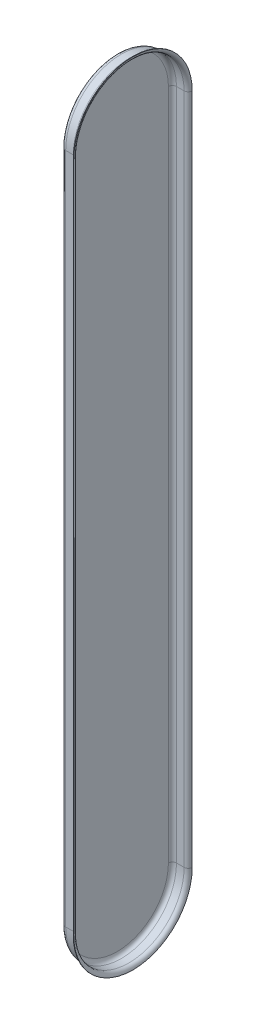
ISO-10303-21;
HEADER;
FILE_DESCRIPTION(('STEP AP214'),'2;1');
FILE_NAME('part.step','',(''),(''),'','','');
FILE_SCHEMA(('AUTOMOTIVE_DESIGN { 1 0 10303 214 1 1 1 1 }'));
ENDSEC;
DATA;
#1=APPLICATION_CONTEXT('core data for automotive mechanical design processes');
#2=APPLICATION_PROTOCOL_DEFINITION('international standard','automotive_design',2000,#1);
#3=PRODUCT_CONTEXT('',#1,'mechanical');
#4=PRODUCT('Part','Part','',(#3));
#5=PRODUCT_RELATED_PRODUCT_CATEGORY('part','',(#4));
#6=PRODUCT_DEFINITION_FORMATION('','',#4);
#7=PRODUCT_DEFINITION_CONTEXT('part definition',#1,'design');
#8=PRODUCT_DEFINITION('design','',#6,#7);
#9=PRODUCT_DEFINITION_SHAPE('','',#8);
#10=(LENGTH_UNIT() NAMED_UNIT(*) SI_UNIT(.MILLI.,.METRE.));
#11=(NAMED_UNIT(*) PLANE_ANGLE_UNIT() SI_UNIT($,.RADIAN.));
#12=(NAMED_UNIT(*) SI_UNIT($,.STERADIAN.) SOLID_ANGLE_UNIT());
#13=UNCERTAINTY_MEASURE_WITH_UNIT(LENGTH_MEASURE(1.E-05),#10,'distance_accuracy_value','');
#14=(GEOMETRIC_REPRESENTATION_CONTEXT(3) GLOBAL_UNCERTAINTY_ASSIGNED_CONTEXT((#13)) GLOBAL_UNIT_ASSIGNED_CONTEXT((#10,
#11,#12)) REPRESENTATION_CONTEXT('',''));
#15=CARTESIAN_POINT('',(0.,0.,0.));
#16=DIRECTION('',(0.,0.,1.));
#17=DIRECTION('',(1.,0.,0.));
#18=AXIS2_PLACEMENT_3D('',#15,#16,#17);
#19=CARTESIAN_POINT('',(-39.35,19.28,3.99999999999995));
#20=DIRECTION('',(-1.,0.,0.));
#21=DIRECTION('',(0.,-1.,0.));
#22=AXIS2_PLACEMENT_3D('',#19,#20,#21);
#23=PLANE('',#22);
#24=DIRECTION('',(0.,-1.,0.));
#25=VECTOR('',#24,1.);
#26=CARTESIAN_POINT('',(-39.35,19.28,5.13999999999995));
#27=LINE('',#26,#25);
#28=CARTESIAN_POINT('',(-39.35,34.27,5.13999999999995));
#29=VERTEX_POINT('',#28);
#30=CARTESIAN_POINT('',(-39.35,19.28,5.13999999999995));
#31=VERTEX_POINT('',#30);
#32=EDGE_CURVE('E133',#29,#31,#27,.T.);
#33=ORIENTED_EDGE('',*,*,#32,.T.);
#34=CARTESIAN_POINT('',(-39.35,19.28,3.99999999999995));
#35=DIRECTION('',(-1.,0.,0.));
#36=DIRECTION('',(0.,0.,-1.));
#37=AXIS2_PLACEMENT_3D('',#34,#35,#36);
#38=CIRCLE('',#37,1.14);
#39=CARTESIAN_POINT('',(-39.35,19.28,2.85999999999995));
#40=VERTEX_POINT('',#39);
#41=EDGE_CURVE('E162',#31,#40,#38,.F.);
#42=ORIENTED_EDGE('',*,*,#41,.T.);
#43=DIRECTION('',(0.,1.,0.));
#44=VECTOR('',#43,1.);
#45=CARTESIAN_POINT('',(-39.35,19.28,2.85999999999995));
#46=LINE('',#45,#44);
#47=CARTESIAN_POINT('',(-39.35,34.27,2.85999999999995));
#48=VERTEX_POINT('',#47);
#49=EDGE_CURVE('E136',#40,#48,#46,.T.);
#50=ORIENTED_EDGE('',*,*,#49,.T.);
#51=CARTESIAN_POINT('',(-39.35,34.27,3.99999999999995));
#52=DIRECTION('',(-1.,0.,0.));
#53=DIRECTION('',(0.,0.,1.));
#54=AXIS2_PLACEMENT_3D('',#51,#52,#53);
#55=CIRCLE('',#54,1.14);
#56=EDGE_CURVE('E129',#48,#29,#55,.F.);
#57=ORIENTED_EDGE('',*,*,#56,.T.);
#58=EDGE_LOOP('',(#33,#42,#50,#57));
#59=FACE_BOUND('',#58,.T.);
#60=ADVANCED_FACE('F17',(#59),#23,.F.);
#61=CARTESIAN_POINT('',(-39.26,34.27,3.99999999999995));
#62=DIRECTION('',(-1.,0.,0.));
#63=DIRECTION('',(0.,1.,0.));
#64=AXIS2_PLACEMENT_3D('',#61,#62,#63);
#65=TOROIDAL_SURFACE('',#64,1.14,0.09);
#66=ORIENTED_EDGE('',*,*,#56,.F.);
#67=CARTESIAN_POINT('',(-39.26,34.27,2.85999999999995));
#68=DIRECTION('',(0.,1.,0.));
#69=DIRECTION('',(-1.,0.,0.));
#70=AXIS2_PLACEMENT_3D('',#67,#68,#69);
#71=CIRCLE('',#70,0.0899999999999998);
#72=CARTESIAN_POINT('',(-39.26,34.27,2.76999999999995));
#73=VERTEX_POINT('',#72);
#74=EDGE_CURVE('E173',#48,#73,#71,.F.);
#75=ORIENTED_EDGE('',*,*,#74,.T.);
#76=CARTESIAN_POINT('',(-39.26,34.27,3.99999999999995));
#77=DIRECTION('',(1.,0.,0.));
#78=DIRECTION('',(0.,1.,0.));
#79=AXIS2_PLACEMENT_3D('',#76,#77,#78);
#80=CIRCLE('',#79,1.23);
#81=CARTESIAN_POINT('',(-39.26,34.27,5.22999999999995));
#82=VERTEX_POINT('',#81);
#83=EDGE_CURVE('E145',#73,#82,#80,.T.);
#84=ORIENTED_EDGE('',*,*,#83,.T.);
#85=CARTESIAN_POINT('',(-39.26,34.27,5.13999999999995));
#86=DIRECTION('',(0.,-1.,0.));
#87=DIRECTION('',(1.,0.,0.));
#88=AXIS2_PLACEMENT_3D('',#85,#86,#87);
#89=CIRCLE('',#88,0.0899999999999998);
#90=EDGE_CURVE('E142',#82,#29,#89,.T.);
#91=ORIENTED_EDGE('',*,*,#90,.T.);
#92=EDGE_LOOP('',(#66,#75,#84,#91));
#93=FACE_BOUND('',#92,.T.);
#94=ADVANCED_FACE('F143',(#93),#65,.F.);
#95=CARTESIAN_POINT('',(-39.26,19.28,2.85999999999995));
#96=DIRECTION('',(0.,1.,0.));
#97=DIRECTION('',(-1.,0.,0.));
#98=AXIS2_PLACEMENT_3D('',#95,#96,#97);
#99=CYLINDRICAL_SURFACE('',#98,0.0899999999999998);
#100=ORIENTED_EDGE('',*,*,#49,.F.);
#101=CARTESIAN_POINT('',(-39.26,19.28,2.85999999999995));
#102=DIRECTION('',(0.,-1.,0.));
#103=DIRECTION('',(0.,0.,-1.));
#104=AXIS2_PLACEMENT_3D('',#101,#102,#103);
#105=CIRCLE('',#104,0.09);
#106=CARTESIAN_POINT('',(-39.26,19.28,2.76999999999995));
#107=VERTEX_POINT('',#106);
#108=EDGE_CURVE('E149',#40,#107,#105,.T.);
#109=ORIENTED_EDGE('',*,*,#108,.T.);
#110=DIRECTION('',(0.,1.,0.));
#111=VECTOR('',#110,1.);
#112=CARTESIAN_POINT('',(-39.26,19.28,2.76999999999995));
#113=LINE('',#112,#111);
#114=EDGE_CURVE('E200',#73,#107,#113,.F.);
#115=ORIENTED_EDGE('',*,*,#114,.F.);
#116=ORIENTED_EDGE('',*,*,#74,.F.);
#117=EDGE_LOOP('',(#100,#109,#115,#116));
#118=FACE_BOUND('',#117,.T.);
#119=ADVANCED_FACE('F175',(#118),#99,.F.);
#120=CARTESIAN_POINT('',(-39.26,19.28,3.99999999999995));
#121=DIRECTION('',(-1.,0.,0.));
#122=DIRECTION('',(0.,-1.,0.));
#123=AXIS2_PLACEMENT_3D('',#120,#121,#122);
#124=TOROIDAL_SURFACE('',#123,1.14,0.09);
#125=ORIENTED_EDGE('',*,*,#108,.F.);
#126=ORIENTED_EDGE('',*,*,#41,.F.);
#127=CARTESIAN_POINT('',(-39.26,19.28,5.13999999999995));
#128=DIRECTION('',(0.,-1.,0.));
#129=DIRECTION('',(1.,0.,0.));
#130=AXIS2_PLACEMENT_3D('',#127,#128,#129);
#131=CIRCLE('',#130,0.0899999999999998);
#132=CARTESIAN_POINT('',(-39.26,19.28,5.22999999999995));
#133=VERTEX_POINT('',#132);
#134=EDGE_CURVE('E153',#31,#133,#131,.F.);
#135=ORIENTED_EDGE('',*,*,#134,.T.);
#136=CARTESIAN_POINT('',(-39.26,19.28,3.99999999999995));
#137=DIRECTION('',(1.,0.,0.));
#138=DIRECTION('',(0.,1.,0.));
#139=AXIS2_PLACEMENT_3D('',#136,#137,#138);
#140=CIRCLE('',#139,1.23);
#141=EDGE_CURVE('E181',#133,#107,#140,.T.);
#142=ORIENTED_EDGE('',*,*,#141,.T.);
#143=EDGE_LOOP('',(#125,#126,#135,#142));
#144=FACE_BOUND('',#143,.T.);
#145=ADVANCED_FACE('F179',(#144),#124,.F.);
#146=CARTESIAN_POINT('',(-39.26,19.28,5.13999999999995));
#147=DIRECTION('',(0.,-1.,0.));
#148=DIRECTION('',(1.,0.,0.));
#149=AXIS2_PLACEMENT_3D('',#146,#147,#148);
#150=CYLINDRICAL_SURFACE('',#149,0.0899999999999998);
#151=ORIENTED_EDGE('',*,*,#32,.F.);
#152=ORIENTED_EDGE('',*,*,#90,.F.);
#153=DIRECTION('',(0.,1.,0.));
#154=VECTOR('',#153,1.);
#155=CARTESIAN_POINT('',(-39.26,19.28,5.22999999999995));
#156=LINE('',#155,#154);
#157=EDGE_CURVE('E218',#133,#82,#156,.T.);
#158=ORIENTED_EDGE('',*,*,#157,.F.);
#159=ORIENTED_EDGE('',*,*,#134,.F.);
#160=EDGE_LOOP('',(#151,#152,#158,#159));
#161=FACE_BOUND('',#160,.T.);
#162=ADVANCED_FACE('F152',(#161),#150,.F.);
#163=CARTESIAN_POINT('',(-39.35,34.27,3.99999999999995));
#164=DIRECTION('',(1.,0.,0.));
#165=DIRECTION('',(0.,1.,0.));
#166=AXIS2_PLACEMENT_3D('',#163,#164,#165);
#167=CYLINDRICAL_SURFACE('',#166,1.23);
#168=DIRECTION('',(1.,0.,0.));
#169=VECTOR('',#168,1.);
#170=CARTESIAN_POINT('',(-39.35,34.27,2.76999999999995));
#171=LINE('',#170,#169);
#172=CARTESIAN_POINT('',(-39.09,34.27,2.76999999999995));
#173=VERTEX_POINT('',#172);
#174=EDGE_CURVE('E194',#173,#73,#171,.F.);
#175=ORIENTED_EDGE('',*,*,#174,.F.);
#176=CARTESIAN_POINT('',(-39.09,34.27,3.99999999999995));
#177=DIRECTION('',(-1.,0.,0.));
#178=DIRECTION('',(0.,1.,0.));
#179=AXIS2_PLACEMENT_3D('',#176,#177,#178);
#180=CIRCLE('',#179,1.23);
#181=CARTESIAN_POINT('',(-39.09,34.27,5.22999999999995));
#182=VERTEX_POINT('',#181);
#183=EDGE_CURVE('E250',#182,#173,#180,.T.);
#184=ORIENTED_EDGE('',*,*,#183,.F.);
#185=DIRECTION('',(-1.,0.,0.));
#186=VECTOR('',#185,1.);
#187=CARTESIAN_POINT('',(-39.35,34.27,5.22999999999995));
#188=LINE('',#187,#186);
#189=EDGE_CURVE('E197',#82,#182,#188,.F.);
#190=ORIENTED_EDGE('',*,*,#189,.F.);
#191=ORIENTED_EDGE('',*,*,#83,.F.);
#192=EDGE_LOOP('',(#175,#184,#190,#191));
#193=FACE_BOUND('',#192,.T.);
#194=ADVANCED_FACE('F192',(#193),#167,.F.);
#195=CARTESIAN_POINT('',(-39.35,19.28,2.76999999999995));
#196=DIRECTION('',(0.,0.,1.));
#197=DIRECTION('',(1.,0.,0.));
#198=AXIS2_PLACEMENT_3D('',#195,#196,#197);
#199=PLANE('',#198);
#200=DIRECTION('',(1.,0.,0.));
#201=VECTOR('',#200,1.);
#202=CARTESIAN_POINT('',(-39.35,19.28,2.76999999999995));
#203=LINE('',#202,#201);
#204=CARTESIAN_POINT('',(-39.09,19.28,2.76999999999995));
#205=VERTEX_POINT('',#204);
#206=EDGE_CURVE('E228',#107,#205,#203,.T.);
#207=ORIENTED_EDGE('',*,*,#206,.T.);
#208=DIRECTION('',(0.,-1.,0.));
#209=VECTOR('',#208,1.);
#210=CARTESIAN_POINT('',(-39.09,19.28,2.76999999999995));
#211=LINE('',#210,#209);
#212=EDGE_CURVE('E207',#173,#205,#211,.T.);
#213=ORIENTED_EDGE('',*,*,#212,.F.);
#214=ORIENTED_EDGE('',*,*,#174,.T.);
#215=ORIENTED_EDGE('',*,*,#114,.T.);
#216=EDGE_LOOP('',(#207,#213,#214,#215));
#217=FACE_BOUND('',#216,.T.);
#218=ADVANCED_FACE('F205',(#217),#199,.T.);
#219=CARTESIAN_POINT('',(-39.35,19.28,3.99999999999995));
#220=DIRECTION('',(1.,0.,0.));
#221=DIRECTION('',(0.,1.,0.));
#222=AXIS2_PLACEMENT_3D('',#219,#220,#221);
#223=CYLINDRICAL_SURFACE('',#222,1.23);
#224=CARTESIAN_POINT('',(-39.09,19.28,3.99999999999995));
#225=DIRECTION('',(-1.,0.,0.));
#226=DIRECTION('',(0.,-1.,0.));
#227=AXIS2_PLACEMENT_3D('',#224,#225,#226);
#228=CIRCLE('',#227,1.23);
#229=CARTESIAN_POINT('',(-39.09,19.28,5.22999999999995));
#230=VERTEX_POINT('',#229);
#231=EDGE_CURVE('E238',#205,#230,#228,.T.);
#232=ORIENTED_EDGE('',*,*,#231,.F.);
#233=ORIENTED_EDGE('',*,*,#206,.F.);
#234=ORIENTED_EDGE('',*,*,#141,.F.);
#235=DIRECTION('',(-1.,0.,0.));
#236=VECTOR('',#235,1.);
#237=CARTESIAN_POINT('',(-39.35,19.28,5.22999999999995));
#238=LINE('',#237,#236);
#239=EDGE_CURVE('E220',#230,#133,#238,.T.);
#240=ORIENTED_EDGE('',*,*,#239,.F.);
#241=EDGE_LOOP('',(#232,#233,#234,#240));
#242=FACE_BOUND('',#241,.T.);
#243=ADVANCED_FACE('F276',(#242),#223,.F.);
#244=CARTESIAN_POINT('',(-39.35,19.28,5.22999999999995));
#245=DIRECTION('',(0.,0.,-1.));
#246=DIRECTION('',(-1.,0.,0.));
#247=AXIS2_PLACEMENT_3D('',#244,#245,#246);
#248=PLANE('',#247);
#249=ORIENTED_EDGE('',*,*,#189,.T.);
#250=DIRECTION('',(0.,1.,0.));
#251=VECTOR('',#250,1.);
#252=CARTESIAN_POINT('',(-39.09,19.28,5.22999999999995));
#253=LINE('',#252,#251);
#254=EDGE_CURVE('E253',#230,#182,#253,.T.);
#255=ORIENTED_EDGE('',*,*,#254,.F.);
#256=ORIENTED_EDGE('',*,*,#239,.T.);
#257=ORIENTED_EDGE('',*,*,#157,.T.);
#258=EDGE_LOOP('',(#249,#255,#256,#257));
#259=FACE_BOUND('',#258,.T.);
#260=ADVANCED_FACE('F271',(#259),#248,.T.);
#261=CARTESIAN_POINT('',(-39.09,34.27,3.99999999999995));
#262=DIRECTION('',(-1.,0.,0.));
#263=DIRECTION('',(0.,1.,0.));
#264=AXIS2_PLACEMENT_3D('',#261,#262,#263);
#265=TOROIDAL_SURFACE('',#264,1.32,0.09);
#266=CARTESIAN_POINT('',(-39.09,34.27,2.67999999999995));
#267=DIRECTION('',(0.,-1.,0.));
#268=DIRECTION('',(1.,0.,0.));
#269=AXIS2_PLACEMENT_3D('',#266,#267,#268);
#270=CIRCLE('',#269,0.0899999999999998);
#271=CARTESIAN_POINT('',(-39.,34.27,2.67999999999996));
#272=VERTEX_POINT('',#271);
#273=EDGE_CURVE('E239',#272,#173,#270,.T.);
#274=ORIENTED_EDGE('',*,*,#273,.F.);
#275=CARTESIAN_POINT('',(-39.,34.27,3.99999999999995));
#276=DIRECTION('',(-1.,0.,0.));
#277=DIRECTION('',(0.,-1.,0.));
#278=AXIS2_PLACEMENT_3D('',#275,#276,#277);
#279=CIRCLE('',#278,1.32);
#280=CARTESIAN_POINT('',(-39.,34.27,5.31999999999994));
#281=VERTEX_POINT('',#280);
#282=EDGE_CURVE('E533',#281,#272,#279,.T.);
#283=ORIENTED_EDGE('',*,*,#282,.F.);
#284=CARTESIAN_POINT('',(-39.09,34.27,5.31999999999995));
#285=DIRECTION('',(0.,1.,0.));
#286=DIRECTION('',(-1.,0.,0.));
#287=AXIS2_PLACEMENT_3D('',#284,#285,#286);
#288=CIRCLE('',#287,0.0899999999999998);
#289=EDGE_CURVE('E256',#182,#281,#288,.F.);
#290=ORIENTED_EDGE('',*,*,#289,.F.);
#291=ORIENTED_EDGE('',*,*,#183,.T.);
#292=EDGE_LOOP('',(#274,#283,#290,#291));
#293=FACE_BOUND('',#292,.T.);
#294=ADVANCED_FACE('F266',(#293),#265,.T.);
#295=CARTESIAN_POINT('',(-39.09,19.28,2.67999999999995));
#296=DIRECTION('',(0.,-1.,0.));
#297=DIRECTION('',(1.,0.,0.));
#298=AXIS2_PLACEMENT_3D('',#295,#296,#297);
#299=CYLINDRICAL_SURFACE('',#298,0.0899999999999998);
#300=CARTESIAN_POINT('',(-39.09,19.28,2.67999999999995));
#301=DIRECTION('',(0.,-1.,0.));
#302=DIRECTION('',(0.,0.,-1.));
#303=AXIS2_PLACEMENT_3D('',#300,#301,#302);
#304=CIRCLE('',#303,0.09);
#305=CARTESIAN_POINT('',(-39.,19.28,2.67999999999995));
#306=VERTEX_POINT('',#305);
#307=EDGE_CURVE('E244',#306,#205,#304,.T.);
#308=ORIENTED_EDGE('',*,*,#307,.F.);
#309=DIRECTION('',(0.,1.,0.));
#310=VECTOR('',#309,1.);
#311=CARTESIAN_POINT('',(-39.,26.775,2.67999999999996));
#312=LINE('',#311,#310);
#313=EDGE_CURVE('E532',#306,#272,#312,.T.);
#314=ORIENTED_EDGE('',*,*,#313,.T.);
#315=ORIENTED_EDGE('',*,*,#273,.T.);
#316=ORIENTED_EDGE('',*,*,#212,.T.);
#317=EDGE_LOOP('',(#308,#314,#315,#316));
#318=FACE_BOUND('',#317,.T.);
#319=ADVANCED_FACE('F270',(#318),#299,.T.);
#320=CARTESIAN_POINT('',(-39.09,19.28,3.99999999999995));
#321=DIRECTION('',(-1.,0.,0.));
#322=DIRECTION('',(0.,-1.,0.));
#323=AXIS2_PLACEMENT_3D('',#320,#321,#322);
#324=TOROIDAL_SURFACE('',#323,1.32,0.09);
#325=CARTESIAN_POINT('',(-39.,19.28,3.99999999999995));
#326=DIRECTION('',(-1.,0.,0.));
#327=DIRECTION('',(0.,-1.,0.));
#328=AXIS2_PLACEMENT_3D('',#325,#326,#327);
#329=CIRCLE('',#328,1.32);
#330=CARTESIAN_POINT('',(-39.,19.28,5.31999999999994));
#331=VERTEX_POINT('',#330);
#332=EDGE_CURVE('E527',#306,#331,#329,.T.);
#333=ORIENTED_EDGE('',*,*,#332,.F.);
#334=ORIENTED_EDGE('',*,*,#307,.T.);
#335=ORIENTED_EDGE('',*,*,#231,.T.);
#336=CARTESIAN_POINT('',(-39.09,19.28,5.31999999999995));
#337=DIRECTION('',(0.,1.,0.));
#338=DIRECTION('',(-1.,0.,0.));
#339=AXIS2_PLACEMENT_3D('',#336,#337,#338);
#340=CIRCLE('',#339,0.0899999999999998);
#341=EDGE_CURVE('E257',#331,#230,#340,.T.);
#342=ORIENTED_EDGE('',*,*,#341,.F.);
#343=EDGE_LOOP('',(#333,#334,#335,#342));
#344=FACE_BOUND('',#343,.T.);
#345=ADVANCED_FACE('F563',(#344),#324,.T.);
#346=CARTESIAN_POINT('',(-39.09,19.28,5.31999999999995));
#347=DIRECTION('',(0.,1.,0.));
#348=DIRECTION('',(-1.,0.,0.));
#349=AXIS2_PLACEMENT_3D('',#346,#347,#348);
#350=CYLINDRICAL_SURFACE('',#349,0.0899999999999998);
#351=ORIENTED_EDGE('',*,*,#289,.T.);
#352=DIRECTION('',(0.,1.,0.));
#353=VECTOR('',#352,1.);
#354=CARTESIAN_POINT('',(-39.,26.775,5.31999999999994));
#355=LINE('',#354,#353);
#356=EDGE_CURVE('E508',#281,#331,#355,.F.);
#357=ORIENTED_EDGE('',*,*,#356,.T.);
#358=ORIENTED_EDGE('',*,*,#341,.T.);
#359=ORIENTED_EDGE('',*,*,#254,.T.);
#360=EDGE_LOOP('',(#351,#357,#358,#359));
#361=FACE_BOUND('',#360,.T.);
#362=ADVANCED_FACE('F566',(#361),#350,.T.);
#363=CARTESIAN_POINT('',(-39.09,34.27,3.99999999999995));
#364=DIRECTION('',(-1.,0.,0.));
#365=DIRECTION('',(0.,-1.,0.));
#366=AXIS2_PLACEMENT_3D('',#363,#364,#365);
#367=CYLINDRICAL_SURFACE('',#366,1.32);
#368=DIRECTION('',(1.,0.,1.35525271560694E-13));
#369=VECTOR('',#368,1.);
#370=CARTESIAN_POINT('',(-39.01,34.27,2.67999999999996));
#371=LINE('',#370,#369);
#372=CARTESIAN_POINT('',(-39.01,34.27,2.67999999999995));
#373=VERTEX_POINT('',#372);
#374=EDGE_CURVE('E530',#272,#373,#371,.F.);
#375=ORIENTED_EDGE('',*,*,#374,.T.);
#376=CARTESIAN_POINT('',(-39.01,34.27,3.99999999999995));
#377=DIRECTION('',(-1.,0.,0.));
#378=DIRECTION('',(0.,1.,0.));
#379=AXIS2_PLACEMENT_3D('',#376,#377,#378);
#380=CIRCLE('',#379,1.32);
#381=CARTESIAN_POINT('',(-39.01,34.27,5.31999999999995));
#382=VERTEX_POINT('',#381);
#383=EDGE_CURVE('E507',#373,#382,#380,.F.);
#384=ORIENTED_EDGE('',*,*,#383,.T.);
#385=DIRECTION('',(-1.,0.,1.30104260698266E-13));
#386=VECTOR('',#385,1.);
#387=CARTESIAN_POINT('',(-39.01,34.27,5.31999999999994));
#388=LINE('',#387,#386);
#389=EDGE_CURVE('E511',#382,#281,#388,.F.);
#390=ORIENTED_EDGE('',*,*,#389,.T.);
#391=ORIENTED_EDGE('',*,*,#282,.T.);
#392=EDGE_LOOP('',(#375,#384,#390,#391));
#393=FACE_BOUND('',#392,.T.);
#394=ADVANCED_FACE('F570',(#393),#367,.T.);
#395=CARTESIAN_POINT('',(-39.01,26.775,2.67999999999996));
#396=DIRECTION('',(-1.35525271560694E-13,0.,1.));
#397=DIRECTION('',(1.,0.,1.35525271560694E-13));
#398=AXIS2_PLACEMENT_3D('',#395,#396,#397);
#399=PLANE('',#398);
#400=DIRECTION('',(-1.,0.,0.));
#401=VECTOR('',#400,1.);
#402=CARTESIAN_POINT('',(-39.09,19.28,2.67999999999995));
#403=LINE('',#402,#401);
#404=CARTESIAN_POINT('',(-39.01,19.28,2.67999999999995));
#405=VERTEX_POINT('',#404);
#406=EDGE_CURVE('E514',#405,#306,#403,.F.);
#407=ORIENTED_EDGE('',*,*,#406,.F.);
#408=DIRECTION('',(0.,-1.,0.));
#409=VECTOR('',#408,1.);
#410=CARTESIAN_POINT('',(-39.01,19.28,2.67999999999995));
#411=LINE('',#410,#409);
#412=EDGE_CURVE('E518',#405,#373,#411,.F.);
#413=ORIENTED_EDGE('',*,*,#412,.T.);
#414=ORIENTED_EDGE('',*,*,#374,.F.);
#415=ORIENTED_EDGE('',*,*,#313,.F.);
#416=EDGE_LOOP('',(#407,#413,#414,#415));
#417=FACE_BOUND('',#416,.T.);
#418=ADVANCED_FACE('F574',(#417),#399,.F.);
#419=CARTESIAN_POINT('',(-39.09,19.28,3.99999999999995));
#420=DIRECTION('',(-1.,0.,0.));
#421=DIRECTION('',(0.,-1.,0.));
#422=AXIS2_PLACEMENT_3D('',#419,#420,#421);
#423=CYLINDRICAL_SURFACE('',#422,1.32);
#424=CARTESIAN_POINT('',(-39.01,19.28,3.99999999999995));
#425=DIRECTION('',(-1.,0.,0.));
#426=DIRECTION('',(0.,-1.,0.));
#427=AXIS2_PLACEMENT_3D('',#424,#425,#426);
#428=CIRCLE('',#427,1.32);
#429=CARTESIAN_POINT('',(-39.01,19.28,5.31999999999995));
#430=VERTEX_POINT('',#429);
#431=EDGE_CURVE('E495',#430,#405,#428,.F.);
#432=ORIENTED_EDGE('',*,*,#431,.T.);
#433=ORIENTED_EDGE('',*,*,#406,.T.);
#434=ORIENTED_EDGE('',*,*,#332,.T.);
#435=DIRECTION('',(-1.,0.,1.30104260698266E-13));
#436=VECTOR('',#435,1.);
#437=CARTESIAN_POINT('',(-39.01,19.28,5.31999999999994));
#438=LINE('',#437,#436);
#439=EDGE_CURVE('E505',#331,#430,#438,.T.);
#440=ORIENTED_EDGE('',*,*,#439,.T.);
#441=EDGE_LOOP('',(#432,#433,#434,#440));
#442=FACE_BOUND('',#441,.T.);
#443=ADVANCED_FACE('F577',(#442),#423,.T.);
#444=CARTESIAN_POINT('',(-39.01,26.775,5.31999999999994));
#445=DIRECTION('',(-1.30104260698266E-13,0.,-1.));
#446=DIRECTION('',(-1.,0.,1.30104260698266E-13));
#447=AXIS2_PLACEMENT_3D('',#444,#445,#446);
#448=PLANE('',#447);
#449=ORIENTED_EDGE('',*,*,#356,.F.);
#450=ORIENTED_EDGE('',*,*,#389,.F.);
#451=DIRECTION('',(0.,1.,0.));
#452=VECTOR('',#451,1.);
#453=CARTESIAN_POINT('',(-39.01,19.28,5.31999999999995));
#454=LINE('',#453,#452);
#455=EDGE_CURVE('E455',#382,#430,#454,.F.);
#456=ORIENTED_EDGE('',*,*,#455,.T.);
#457=ORIENTED_EDGE('',*,*,#439,.F.);
#458=EDGE_LOOP('',(#449,#450,#456,#457));
#459=FACE_BOUND('',#458,.T.);
#460=ADVANCED_FACE('F487',(#459),#448,.F.);
#461=CARTESIAN_POINT('',(-39.09,34.27,3.99999999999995));
#462=DIRECTION('',(-1.,0.,0.));
#463=DIRECTION('',(0.,1.,0.));
#464=AXIS2_PLACEMENT_3D('',#461,#462,#463);
#465=TOROIDAL_SURFACE('',#464,1.32,0.08);
#466=ORIENTED_EDGE('',*,*,#383,.F.);
#467=CARTESIAN_POINT('',(-39.09,34.27,2.67999999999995));
#468=DIRECTION('',(0.,-1.,0.));
#469=DIRECTION('',(1.,0.,0.));
#470=AXIS2_PLACEMENT_3D('',#467,#468,#469);
#471=CIRCLE('',#470,0.0799999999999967);
#472=CARTESIAN_POINT('',(-39.09,34.27,2.75999999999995));
#473=VERTEX_POINT('',#472);
#474=EDGE_CURVE('E498',#373,#473,#471,.T.);
#475=ORIENTED_EDGE('',*,*,#474,.T.);
#476=CARTESIAN_POINT('',(-39.09,34.27,3.99999999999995));
#477=DIRECTION('',(1.,0.,0.));
#478=DIRECTION('',(0.,1.,0.));
#479=AXIS2_PLACEMENT_3D('',#476,#477,#478);
#480=CIRCLE('',#479,1.24);
#481=CARTESIAN_POINT('',(-39.09,34.27,5.23999999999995));
#482=VERTEX_POINT('',#481);
#483=EDGE_CURVE('E454',#482,#473,#480,.F.);
#484=ORIENTED_EDGE('',*,*,#483,.F.);
#485=CARTESIAN_POINT('',(-39.09,34.27,5.31999999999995));
#486=DIRECTION('',(0.,1.,0.));
#487=DIRECTION('',(-1.,0.,0.));
#488=AXIS2_PLACEMENT_3D('',#485,#486,#487);
#489=CIRCLE('',#488,0.0799999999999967);
#490=EDGE_CURVE('E458',#482,#382,#489,.F.);
#491=ORIENTED_EDGE('',*,*,#490,.T.);
#492=EDGE_LOOP('',(#466,#475,#484,#491));
#493=FACE_BOUND('',#492,.T.);
#494=ADVANCED_FACE('F482',(#493),#465,.F.);
#495=CARTESIAN_POINT('',(-39.09,19.28,2.67999999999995));
#496=DIRECTION('',(0.,-1.,0.));
#497=DIRECTION('',(1.,0.,0.));
#498=AXIS2_PLACEMENT_3D('',#495,#496,#497);
#499=CYLINDRICAL_SURFACE('',#498,0.0799999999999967);
#500=ORIENTED_EDGE('',*,*,#412,.F.);
#501=CARTESIAN_POINT('',(-39.09,19.28,2.67999999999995));
#502=DIRECTION('',(0.,-1.,0.));
#503=DIRECTION('',(0.,0.,-1.));
#504=AXIS2_PLACEMENT_3D('',#501,#502,#503);
#505=CIRCLE('',#504,0.08);
#506=CARTESIAN_POINT('',(-39.09,19.28,2.75999999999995));
#507=VERTEX_POINT('',#506);
#508=EDGE_CURVE('E461',#405,#507,#505,.T.);
#509=ORIENTED_EDGE('',*,*,#508,.T.);
#510=DIRECTION('',(0.,1.,0.));
#511=VECTOR('',#510,1.);
#512=CARTESIAN_POINT('',(-39.09,19.28,2.75999999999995));
#513=LINE('',#512,#511);
#514=EDGE_CURVE('E441',#507,#473,#513,.T.);
#515=ORIENTED_EDGE('',*,*,#514,.T.);
#516=ORIENTED_EDGE('',*,*,#474,.F.);
#517=EDGE_LOOP('',(#500,#509,#515,#516));
#518=FACE_BOUND('',#517,.T.);
#519=ADVANCED_FACE('F477',(#518),#499,.F.);
#520=CARTESIAN_POINT('',(-39.09,19.28,3.99999999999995));
#521=DIRECTION('',(-1.,0.,0.));
#522=DIRECTION('',(0.,-1.,0.));
#523=AXIS2_PLACEMENT_3D('',#520,#521,#522);
#524=TOROIDAL_SURFACE('',#523,1.32,0.08);
#525=ORIENTED_EDGE('',*,*,#508,.F.);
#526=ORIENTED_EDGE('',*,*,#431,.F.);
#527=CARTESIAN_POINT('',(-39.09,19.28,5.31999999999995));
#528=DIRECTION('',(0.,1.,0.));
#529=DIRECTION('',(-1.,0.,0.));
#530=AXIS2_PLACEMENT_3D('',#527,#528,#529);
#531=CIRCLE('',#530,0.0799999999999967);
#532=CARTESIAN_POINT('',(-39.09,19.28,5.23999999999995));
#533=VERTEX_POINT('',#532);
#534=EDGE_CURVE('E452',#430,#533,#531,.T.);
#535=ORIENTED_EDGE('',*,*,#534,.T.);
#536=CARTESIAN_POINT('',(-39.09,19.28,3.99999999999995));
#537=DIRECTION('',(1.,0.,0.));
#538=DIRECTION('',(0.,1.,0.));
#539=AXIS2_PLACEMENT_3D('',#536,#537,#538);
#540=CIRCLE('',#539,1.24);
#541=EDGE_CURVE('E421',#507,#533,#540,.F.);
#542=ORIENTED_EDGE('',*,*,#541,.F.);
#543=EDGE_LOOP('',(#525,#526,#535,#542));
#544=FACE_BOUND('',#543,.T.);
#545=ADVANCED_FACE('F472',(#544),#524,.F.);
#546=CARTESIAN_POINT('',(-39.09,19.28,5.31999999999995));
#547=DIRECTION('',(0.,1.,0.));
#548=DIRECTION('',(-1.,0.,0.));
#549=AXIS2_PLACEMENT_3D('',#546,#547,#548);
#550=CYLINDRICAL_SURFACE('',#549,0.0799999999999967);
#551=ORIENTED_EDGE('',*,*,#455,.F.);
#552=ORIENTED_EDGE('',*,*,#490,.F.);
#553=DIRECTION('',(0.,1.,0.));
#554=VECTOR('',#553,1.);
#555=CARTESIAN_POINT('',(-39.09,19.28,5.23999999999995));
#556=LINE('',#555,#554);
#557=EDGE_CURVE('E420',#482,#533,#556,.F.);
#558=ORIENTED_EDGE('',*,*,#557,.T.);
#559=ORIENTED_EDGE('',*,*,#534,.F.);
#560=EDGE_LOOP('',(#551,#552,#558,#559));
#561=FACE_BOUND('',#560,.T.);
#562=ADVANCED_FACE('F476',(#561),#550,.F.);
#563=CARTESIAN_POINT('',(-39.35,34.27,3.99999999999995));
#564=DIRECTION('',(1.,0.,0.));
#565=DIRECTION('',(0.,1.,0.));
#566=AXIS2_PLACEMENT_3D('',#563,#564,#565);
#567=CYLINDRICAL_SURFACE('',#566,1.24);
#568=ORIENTED_EDGE('',*,*,#483,.T.);
#569=DIRECTION('',(1.,0.,0.));
#570=VECTOR('',#569,1.);
#571=CARTESIAN_POINT('',(-39.35,34.27,2.75999999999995));
#572=LINE('',#571,#570);
#573=CARTESIAN_POINT('',(-39.26,34.27,2.75999999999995));
#574=VERTEX_POINT('',#573);
#575=EDGE_CURVE('E437',#473,#574,#572,.F.);
#576=ORIENTED_EDGE('',*,*,#575,.T.);
#577=CARTESIAN_POINT('',(-39.26,34.27,3.99999999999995));
#578=DIRECTION('',(-1.,0.,0.));
#579=DIRECTION('',(0.,1.,0.));
#580=AXIS2_PLACEMENT_3D('',#577,#578,#579);
#581=CIRCLE('',#580,1.24000000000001);
#582=CARTESIAN_POINT('',(-39.26,34.27,5.23999999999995));
#583=VERTEX_POINT('',#582);
#584=EDGE_CURVE('E386',#583,#574,#581,.T.);
#585=ORIENTED_EDGE('',*,*,#584,.F.);
#586=DIRECTION('',(-1.,0.,0.));
#587=VECTOR('',#586,1.);
#588=CARTESIAN_POINT('',(-39.35,34.27,5.23999999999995));
#589=LINE('',#588,#587);
#590=EDGE_CURVE('E417',#583,#482,#589,.F.);
#591=ORIENTED_EDGE('',*,*,#590,.T.);
#592=EDGE_LOOP('',(#568,#576,#585,#591));
#593=FACE_BOUND('',#592,.T.);
#594=ADVANCED_FACE('F626',(#593),#567,.T.);
#595=CARTESIAN_POINT('',(-39.35,19.28,2.75999999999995));
#596=DIRECTION('',(0.,0.,1.));
#597=DIRECTION('',(1.,0.,0.));
#598=AXIS2_PLACEMENT_3D('',#595,#596,#597);
#599=PLANE('',#598);
#600=ORIENTED_EDGE('',*,*,#514,.F.);
#601=DIRECTION('',(1.,0.,0.));
#602=VECTOR('',#601,1.);
#603=CARTESIAN_POINT('',(-39.35,19.28,2.75999999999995));
#604=LINE('',#603,#602);
#605=CARTESIAN_POINT('',(-39.26,19.28,2.75999999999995));
#606=VERTEX_POINT('',#605);
#607=EDGE_CURVE('E434',#606,#507,#604,.T.);
#608=ORIENTED_EDGE('',*,*,#607,.F.);
#609=DIRECTION('',(0.,1.,0.));
#610=VECTOR('',#609,1.);
#611=CARTESIAN_POINT('',(-39.26,19.28,2.75999999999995));
#612=LINE('',#611,#610);
#613=EDGE_CURVE('E385',#574,#606,#612,.F.);
#614=ORIENTED_EDGE('',*,*,#613,.F.);
#615=ORIENTED_EDGE('',*,*,#575,.F.);
#616=EDGE_LOOP('',(#600,#608,#614,#615));
#617=FACE_BOUND('',#616,.T.);
#618=ADVANCED_FACE('F602',(#617),#599,.F.);
#619=CARTESIAN_POINT('',(-39.35,19.28,3.99999999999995));
#620=DIRECTION('',(1.,0.,0.));
#621=DIRECTION('',(0.,1.,0.));
#622=AXIS2_PLACEMENT_3D('',#619,#620,#621);
#623=CYLINDRICAL_SURFACE('',#622,1.24);
#624=ORIENTED_EDGE('',*,*,#607,.T.);
#625=ORIENTED_EDGE('',*,*,#541,.T.);
#626=DIRECTION('',(-1.,0.,0.));
#627=VECTOR('',#626,1.);
#628=CARTESIAN_POINT('',(-39.35,19.28,5.23999999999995));
#629=LINE('',#628,#627);
#630=CARTESIAN_POINT('',(-39.26,19.28,5.23999999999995));
#631=VERTEX_POINT('',#630);
#632=EDGE_CURVE('E410',#533,#631,#629,.T.);
#633=ORIENTED_EDGE('',*,*,#632,.T.);
#634=CARTESIAN_POINT('',(-39.26,19.28,3.99999999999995));
#635=DIRECTION('',(-1.,0.,0.));
#636=DIRECTION('',(0.,-1.,0.));
#637=AXIS2_PLACEMENT_3D('',#634,#635,#636);
#638=CIRCLE('',#637,1.24);
#639=EDGE_CURVE('E379',#606,#631,#638,.T.);
#640=ORIENTED_EDGE('',*,*,#639,.F.);
#641=EDGE_LOOP('',(#624,#625,#633,#640));
#642=FACE_BOUND('',#641,.T.);
#643=ADVANCED_FACE('F599',(#642),#623,.T.);
#644=CARTESIAN_POINT('',(-39.35,19.28,5.23999999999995));
#645=DIRECTION('',(0.,0.,-1.));
#646=DIRECTION('',(-1.,0.,0.));
#647=AXIS2_PLACEMENT_3D('',#644,#645,#646);
#648=PLANE('',#647);
#649=ORIENTED_EDGE('',*,*,#557,.F.);
#650=ORIENTED_EDGE('',*,*,#590,.F.);
#651=DIRECTION('',(0.,-1.,0.));
#652=VECTOR('',#651,1.);
#653=CARTESIAN_POINT('',(-39.26,19.28,5.23999999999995));
#654=LINE('',#653,#652);
#655=EDGE_CURVE('E352',#631,#583,#654,.F.);
#656=ORIENTED_EDGE('',*,*,#655,.F.);
#657=ORIENTED_EDGE('',*,*,#632,.F.);
#658=EDGE_LOOP('',(#649,#650,#656,#657));
#659=FACE_BOUND('',#658,.T.);
#660=ADVANCED_FACE('F397',(#659),#648,.F.);
#661=CARTESIAN_POINT('',(-39.26,34.27,3.99999999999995));
#662=DIRECTION('',(-1.,0.,0.));
#663=DIRECTION('',(0.,1.,0.));
#664=AXIS2_PLACEMENT_3D('',#661,#662,#663);
#665=TOROIDAL_SURFACE('',#664,1.14,0.1);
#666=CARTESIAN_POINT('',(-39.26,34.27,2.85999999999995));
#667=DIRECTION('',(0.,1.,0.));
#668=DIRECTION('',(-1.,0.,0.));
#669=AXIS2_PLACEMENT_3D('',#666,#667,#668);
#670=CIRCLE('',#669,0.100000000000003);
#671=CARTESIAN_POINT('',(-39.36,34.27,2.85999999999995));
#672=VERTEX_POINT('',#671);
#673=EDGE_CURVE('E382',#672,#574,#670,.F.);
#674=ORIENTED_EDGE('',*,*,#673,.F.);
#675=CARTESIAN_POINT('',(-39.36,34.27,3.99999999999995));
#676=DIRECTION('',(1.,0.,0.));
#677=DIRECTION('',(0.,0.,-1.));
#678=AXIS2_PLACEMENT_3D('',#675,#676,#677);
#679=CIRCLE('',#678,1.14);
#680=CARTESIAN_POINT('',(-39.36,34.27,5.13999999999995));
#681=VERTEX_POINT('',#680);
#682=EDGE_CURVE('E348',#681,#672,#679,.F.);
#683=ORIENTED_EDGE('',*,*,#682,.F.);
#684=CARTESIAN_POINT('',(-39.26,34.27,5.13999999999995));
#685=DIRECTION('',(0.,-1.,0.));
#686=DIRECTION('',(1.,0.,0.));
#687=AXIS2_PLACEMENT_3D('',#684,#685,#686);
#688=CIRCLE('',#687,0.100000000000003);
#689=EDGE_CURVE('E356',#583,#681,#688,.T.);
#690=ORIENTED_EDGE('',*,*,#689,.F.);
#691=ORIENTED_EDGE('',*,*,#584,.T.);
#692=EDGE_LOOP('',(#674,#683,#690,#691));
#693=FACE_BOUND('',#692,.T.);
#694=ADVANCED_FACE('F393',(#693),#665,.T.);
#695=CARTESIAN_POINT('',(-39.26,19.28,2.85999999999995));
#696=DIRECTION('',(0.,1.,0.));
#697=DIRECTION('',(-1.,0.,0.));
#698=AXIS2_PLACEMENT_3D('',#695,#696,#697);
#699=CYLINDRICAL_SURFACE('',#698,0.100000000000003);
#700=CARTESIAN_POINT('',(-39.26,19.28,2.85999999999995));
#701=DIRECTION('',(0.,-1.,0.));
#702=DIRECTION('',(0.,0.,-1.));
#703=AXIS2_PLACEMENT_3D('',#700,#701,#702);
#704=CIRCLE('',#703,0.1);
#705=CARTESIAN_POINT('',(-39.36,19.28,2.85999999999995));
#706=VERTEX_POINT('',#705);
#707=EDGE_CURVE('E353',#706,#606,#704,.T.);
#708=ORIENTED_EDGE('',*,*,#707,.F.);
#709=DIRECTION('',(0.,-1.,0.));
#710=VECTOR('',#709,1.);
#711=CARTESIAN_POINT('',(-39.36,19.28,2.85999999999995));
#712=LINE('',#711,#710);
#713=EDGE_CURVE('E345',#672,#706,#712,.T.);
#714=ORIENTED_EDGE('',*,*,#713,.F.);
#715=ORIENTED_EDGE('',*,*,#673,.T.);
#716=ORIENTED_EDGE('',*,*,#613,.T.);
#717=EDGE_LOOP('',(#708,#714,#715,#716));
#718=FACE_BOUND('',#717,.T.);
#719=ADVANCED_FACE('F367',(#718),#699,.T.);
#720=CARTESIAN_POINT('',(-39.26,19.28,3.99999999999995));
#721=DIRECTION('',(-1.,0.,0.));
#722=DIRECTION('',(0.,-1.,0.));
#723=AXIS2_PLACEMENT_3D('',#720,#721,#722);
#724=TOROIDAL_SURFACE('',#723,1.14,0.1);
#725=CARTESIAN_POINT('',(-39.36,19.28,3.99999999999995));
#726=DIRECTION('',(1.,0.,0.));
#727=DIRECTION('',(0.,0.,1.));
#728=AXIS2_PLACEMENT_3D('',#725,#726,#727);
#729=CIRCLE('',#728,1.14);
#730=CARTESIAN_POINT('',(-39.36,19.28,5.13999999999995));
#731=VERTEX_POINT('',#730);
#732=EDGE_CURVE('E28',#706,#731,#729,.F.);
#733=ORIENTED_EDGE('',*,*,#732,.F.);
#734=ORIENTED_EDGE('',*,*,#707,.T.);
#735=ORIENTED_EDGE('',*,*,#639,.T.);
#736=CARTESIAN_POINT('',(-39.26,19.28,5.13999999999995));
#737=DIRECTION('',(0.,-1.,0.));
#738=DIRECTION('',(1.,0.,0.));
#739=AXIS2_PLACEMENT_3D('',#736,#737,#738);
#740=CIRCLE('',#739,0.100000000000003);
#741=EDGE_CURVE('E37',#731,#631,#740,.F.);
#742=ORIENTED_EDGE('',*,*,#741,.F.);
#743=EDGE_LOOP('',(#733,#734,#735,#742));
#744=FACE_BOUND('',#743,.T.);
#745=ADVANCED_FACE('F322',(#744),#724,.T.);
#746=CARTESIAN_POINT('',(-39.26,19.28,5.13999999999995));
#747=DIRECTION('',(0.,-1.,0.));
#748=DIRECTION('',(1.,0.,0.));
#749=AXIS2_PLACEMENT_3D('',#746,#747,#748);
#750=CYLINDRICAL_SURFACE('',#749,0.100000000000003);
#751=ORIENTED_EDGE('',*,*,#689,.T.);
#752=DIRECTION('',(0.,-1.,0.));
#753=VECTOR('',#752,1.);
#754=CARTESIAN_POINT('',(-39.36,19.28,5.13999999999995));
#755=LINE('',#754,#753);
#756=EDGE_CURVE('E11',#731,#681,#755,.F.);
#757=ORIENTED_EDGE('',*,*,#756,.F.);
#758=ORIENTED_EDGE('',*,*,#741,.T.);
#759=ORIENTED_EDGE('',*,*,#655,.T.);
#760=EDGE_LOOP('',(#751,#757,#758,#759));
#761=FACE_BOUND('',#760,.T.);
#762=ADVANCED_FACE('F316',(#761),#750,.T.);
#763=CARTESIAN_POINT('',(-39.36,19.28,3.99999999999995));
#764=DIRECTION('',(-1.,0.,0.));
#765=DIRECTION('',(0.,-1.,0.));
#766=AXIS2_PLACEMENT_3D('',#763,#764,#765);
#767=PLANE('',#766);
#768=ORIENTED_EDGE('',*,*,#732,.T.);
#769=ORIENTED_EDGE('',*,*,#756,.T.);
#770=ORIENTED_EDGE('',*,*,#682,.T.);
#771=ORIENTED_EDGE('',*,*,#713,.T.);
#772=EDGE_LOOP('',(#768,#769,#770,#771));
#773=FACE_BOUND('',#772,.T.);
#774=ADVANCED_FACE('F314',(#773),#767,.T.);
#775=CLOSED_SHELL('',(#60,#94,#119,#145,#162,#194,#218,#243,#260,#294,#319,#345,#362,#394,#418,
#443,#460,#494,#519,#545,#562,#594,#618,#643,#660,#694,#719,#745,#762,#774));
#776=MANIFOLD_SOLID_BREP('B1',#775);
#777=ADVANCED_BREP_SHAPE_REPRESENTATION('',(#18,#776),#14);
#778=SHAPE_DEFINITION_REPRESENTATION(#9,#777);
ENDSEC;
END-ISO-10303-21;
